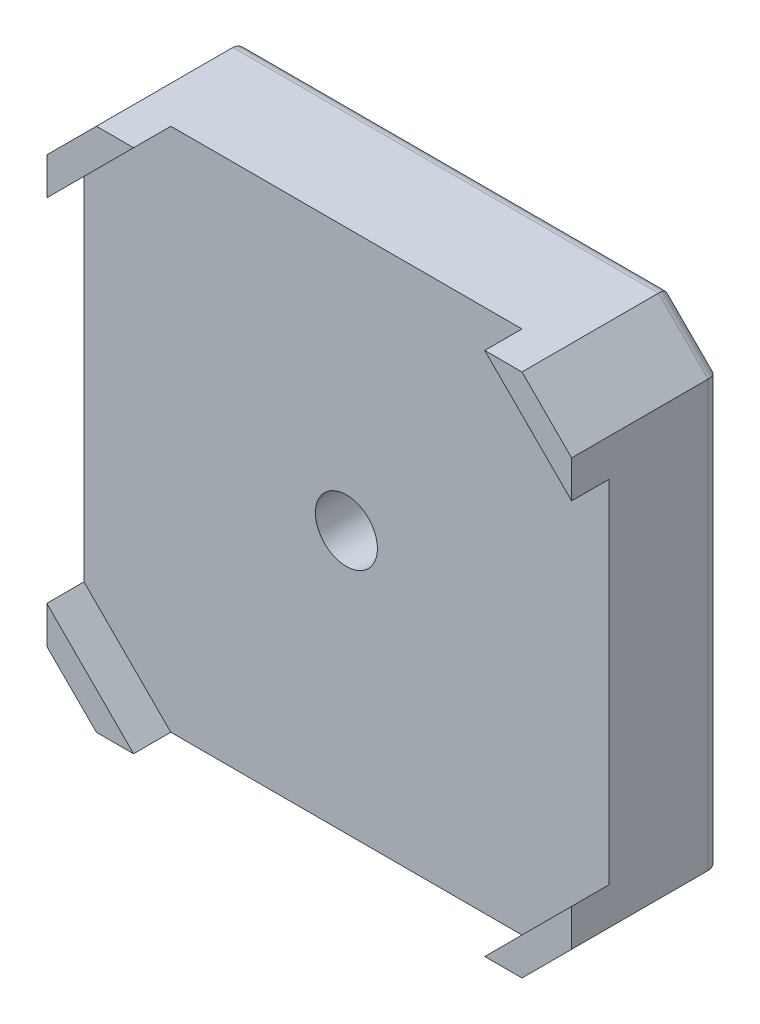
from build123d import *

# Parameters (mm, degrees)
BOSS_EXTRU_1_DEPTH      = 12
ENL_V_MAT_EXTRU_1_DEPTH = 3
ESQUISSE3_R             = 11
BOSS_EXTRU_2_DEPTH      = 2
ESQUISSE4_R             = 5.5
ENL_V_MAT_EXTRU_2_DEPTH = 7
ESQUISSE5_R             = 2.5
ENL_V_MAT_EXTRU_3_DEPTH = 31.718805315
CONG_1_R                = 1
CONG_2_R                = 0.5
ESQUISSE6_R             = 1.5
ENL_V_MAT_EXTRU_4_DEPTH = 3
CONG_3_R                = 0.5


with BuildPart() as part:
    # Esquisse1 → Boss.-Extru.1 (new body)
    with BuildSketch(Plane.XY):
        Polygon((-21.15, 17.15), (-17.15, 21.15), (17.15, 21.15), (21.15, 17.15), (21.15, -17.15), (17.15, -21.15), (-17.15, -21.15), (-21.15, -17.15), align=None)
    extrude(amount=BOSS_EXTRU_1_DEPTH)

    # Esquisse2 → Enl_v. mat.-Extru.1 (cut)
    with BuildSketch(Plane.XY.offset(12)):
        Polygon((-21.15, 14.15), (-14.15, 21.15), (14.15, 21.15), (21.15, 14.15), (21.15, -14.15), (14.15, -21.15), (-14.15, -21.15), (-21.15, -14.15), align=None)
    extrude(amount=-ENL_V_MAT_EXTRU_1_DEPTH, mode=Mode.SUBTRACT)

    # Esquisse3 → Boss.-Extru.2 (add)
    with BuildSketch(Plane(origin=(0, 0, 0), x_dir=(-1, 0, 0), z_dir=(0, 0, -1))):
        Circle(ESQUISSE3_R)
    extrude(amount=BOSS_EXTRU_2_DEPTH)

    # Esquisse4 → Enl_v. mat.-Extru.2 (cut)
    with BuildSketch(Plane(origin=(0, 0, -2), x_dir=(-1, 0, 0), z_dir=(0, 0, -1))):
        Circle(ESQUISSE4_R)
    extrude(amount=-ENL_V_MAT_EXTRU_2_DEPTH, mode=Mode.SUBTRACT)

    # Esquisse5 → Enl_v. mat.-Extru.3 (cut, through all)
    with BuildSketch(Plane(origin=(0, 0, 5), x_dir=(-1, 0, 0), z_dir=(0, 0, -1))):
        Circle(ESQUISSE5_R)
    extrude(amount=-ENL_V_MAT_EXTRU_3_DEPTH, mode=Mode.SUBTRACT)

    # Cong_1
    cong_1_edges = [part.edges().sort_by_distance(p)[0] for p in [
        (-19.15, -19.15, 0),
        (-21.15, 0, 0),
        (-19.15, 19.15, 0),
        (0, 21.15, 0),
        (19.15, 19.15, 0),
        (21.15, 0, 0),
        (19.15, -19.15, 0),
        (0, -21.15, 0),
    ]]
    fillet(cong_1_edges, radius=CONG_1_R)

    # Cong_2
    cong_2_edges = [part.edges().sort_by_distance(p)[0] for p in [
        (11, 0, -2),
        (5.5, 0, 5),
        (5.5, 0, -2),
    ]]
    fillet(cong_2_edges, radius=CONG_2_R)

    # Esquisse6 → Enl_v. mat.-Extru.4 (cut)
    with BuildSketch(Plane(origin=(0, 0, 0), x_dir=(-1, 0, 0), z_dir=(0, 0, -1))):
        with Locations((-15.5, 15.5)):
            Circle(ESQUISSE6_R)
        with Locations((15.5, 15.5)):
            Circle(ESQUISSE6_R)
        with Locations((15.5, -15.5)):
            Circle(ESQUISSE6_R)
        with Locations((-15.5, -15.5)):
            Circle(ESQUISSE6_R)
    extrude(amount=-ENL_V_MAT_EXTRU_4_DEPTH, mode=Mode.SUBTRACT)

    # Cong_3
    cong_3_edges = [part.edges().sort_by_distance(p)[0] for p in [
        (17, -15.5, 0),
        (-14, -15.5, 0),
        (-14, 15.5, 0),
        (17, 15.5, 0),
    ]]
    fillet(cong_3_edges, radius=CONG_3_R)


solid = part.part
